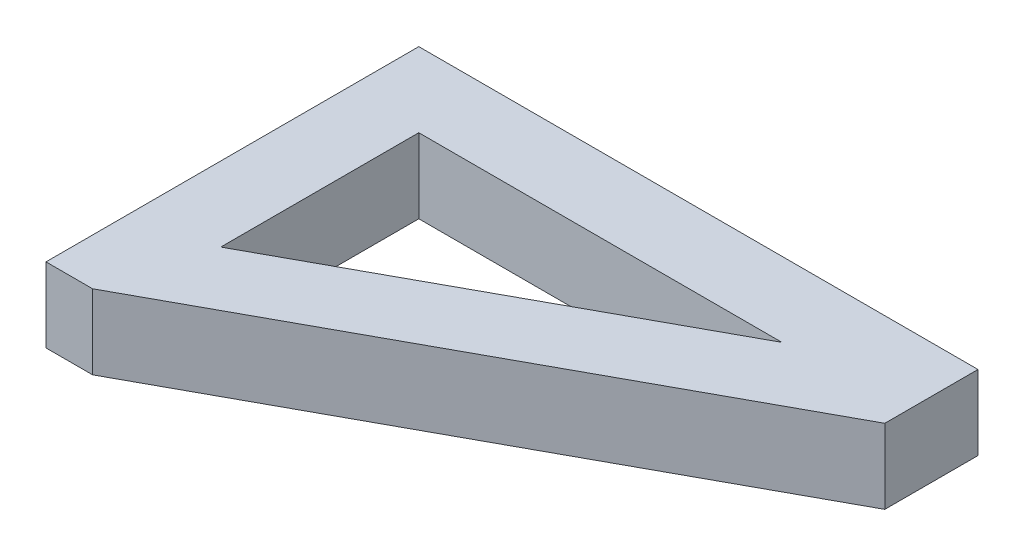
ISO-10303-21;
HEADER;
FILE_DESCRIPTION(('STEP AP214'),'2;1');
FILE_NAME('part.step','',(''),(''),'','','');
FILE_SCHEMA(('AUTOMOTIVE_DESIGN { 1 0 10303 214 1 1 1 1 }'));
ENDSEC;
DATA;
#1=APPLICATION_CONTEXT('core data for automotive mechanical design processes');
#2=APPLICATION_PROTOCOL_DEFINITION('international standard','automotive_design',2000,#1);
#3=PRODUCT_CONTEXT('',#1,'mechanical');
#4=PRODUCT('Part','Part','',(#3));
#5=PRODUCT_RELATED_PRODUCT_CATEGORY('part','',(#4));
#6=PRODUCT_DEFINITION_FORMATION('','',#4);
#7=PRODUCT_DEFINITION_CONTEXT('part definition',#1,'design');
#8=PRODUCT_DEFINITION('design','',#6,#7);
#9=PRODUCT_DEFINITION_SHAPE('','',#8);
#10=(LENGTH_UNIT() NAMED_UNIT(*) SI_UNIT(.MILLI.,.METRE.));
#11=(NAMED_UNIT(*) PLANE_ANGLE_UNIT() SI_UNIT($,.RADIAN.));
#12=(NAMED_UNIT(*) SI_UNIT($,.STERADIAN.) SOLID_ANGLE_UNIT());
#13=UNCERTAINTY_MEASURE_WITH_UNIT(LENGTH_MEASURE(1.E-05),#10,'distance_accuracy_value','');
#14=(GEOMETRIC_REPRESENTATION_CONTEXT(3) GLOBAL_UNCERTAINTY_ASSIGNED_CONTEXT((#13)) GLOBAL_UNIT_ASSIGNED_CONTEXT((#10,
#11,#12)) REPRESENTATION_CONTEXT('',''));
#15=CARTESIAN_POINT('',(0.,0.,0.));
#16=DIRECTION('',(0.,0.,1.));
#17=DIRECTION('',(1.,0.,0.));
#18=AXIS2_PLACEMENT_3D('',#15,#16,#17);
#19=CARTESIAN_POINT('',(0.,20.,0.));
#20=DIRECTION('',(0.,-1.,0.));
#21=DIRECTION('',(0.,0.,-1.));
#22=AXIS2_PLACEMENT_3D('',#19,#20,#21);
#23=PLANE('',#22);
#24=DIRECTION('',(1.,0.,0.));
#25=VECTOR('',#24,1.);
#26=CARTESIAN_POINT('',(12.5,20.,0.));
#27=LINE('',#26,#25);
#28=CARTESIAN_POINT('',(0.,20.,0.));
#29=VERTEX_POINT('',#28);
#30=CARTESIAN_POINT('',(12.5,20.,0.));
#31=VERTEX_POINT('',#30);
#32=EDGE_CURVE('E124',#29,#31,#27,.T.);
#33=ORIENTED_EDGE('',*,*,#32,.T.);
#34=DIRECTION('',(0.877895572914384,0.,-0.478852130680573));
#35=VECTOR('',#34,1.);
#36=CARTESIAN_POINT('',(150.,20.,-75.));
#37=LINE('',#36,#35);
#38=CARTESIAN_POINT('',(150.,20.,-75.));
#39=VERTEX_POINT('',#38);
#40=EDGE_CURVE('E127',#31,#39,#37,.T.);
#41=ORIENTED_EDGE('',*,*,#40,.T.);
#42=DIRECTION('',(0.,0.,-1.));
#43=VECTOR('',#42,1.);
#44=CARTESIAN_POINT('',(150.,20.,-100.));
#45=LINE('',#44,#43);
#46=CARTESIAN_POINT('',(150.,20.,-100.));
#47=VERTEX_POINT('',#46);
#48=EDGE_CURVE('E130',#39,#47,#45,.T.);
#49=ORIENTED_EDGE('',*,*,#48,.T.);
#50=DIRECTION('',(-1.,0.,0.));
#51=VECTOR('',#50,1.);
#52=CARTESIAN_POINT('',(0.,20.,-100.));
#53=LINE('',#52,#51);
#54=CARTESIAN_POINT('',(0.,20.,-100.));
#55=VERTEX_POINT('',#54);
#56=EDGE_CURVE('E132',#47,#55,#53,.T.);
#57=ORIENTED_EDGE('',*,*,#56,.T.);
#58=DIRECTION('',(0.,0.,1.));
#59=VECTOR('',#58,1.);
#60=CARTESIAN_POINT('',(0.,20.,0.));
#61=LINE('',#60,#59);
#62=EDGE_CURVE('E134',#55,#29,#61,.T.);
#63=ORIENTED_EDGE('',*,*,#62,.T.);
#64=EDGE_LOOP('',(#33,#41,#49,#57,#63));
#65=FACE_BOUND('',#64,.T.);
#66=DIRECTION('',(0.,0.,1.));
#67=VECTOR('',#66,1.);
#68=CARTESIAN_POINT('',(20.,20.,-26.872661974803));
#69=LINE('',#68,#67);
#70=CARTESIAN_POINT('',(20.,20.,-80.));
#71=VERTEX_POINT('',#70);
#72=CARTESIAN_POINT('',(20.,20.,-26.872661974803));
#73=VERTEX_POINT('',#72);
#74=EDGE_CURVE('E97',#71,#73,#69,.T.);
#75=ORIENTED_EDGE('',*,*,#74,.F.);
#76=DIRECTION('',(-1.,0.,0.));
#77=VECTOR('',#76,1.);
#78=CARTESIAN_POINT('',(20.,20.,-80.));
#79=LINE('',#78,#77);
#80=CARTESIAN_POINT('',(117.400119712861,20.,-80.));
#81=VERTEX_POINT('',#80);
#82=EDGE_CURVE('E114',#81,#71,#79,.T.);
#83=ORIENTED_EDGE('',*,*,#82,.F.);
#84=DIRECTION('',(0.877895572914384,0.,-0.478852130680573));
#85=VECTOR('',#84,1.);
#86=CARTESIAN_POINT('',(117.400119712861,20.,-80.));
#87=LINE('',#86,#85);
#88=EDGE_CURVE('E105',#73,#81,#87,.T.);
#89=ORIENTED_EDGE('',*,*,#88,.F.);
#90=EDGE_LOOP('',(#75,#83,#89));
#91=FACE_BOUND('',#90,.T.);
#92=ADVANCED_FACE('F32',(#65,#91),#23,.F.);
#93=CARTESIAN_POINT('',(0.,0.,0.));
#94=DIRECTION('',(0.,-1.,0.));
#95=DIRECTION('',(0.,0.,-1.));
#96=AXIS2_PLACEMENT_3D('',#93,#94,#95);
#97=PLANE('',#96);
#98=DIRECTION('',(1.,0.,0.));
#99=VECTOR('',#98,1.);
#100=CARTESIAN_POINT('',(12.5,0.,0.));
#101=LINE('',#100,#99);
#102=CARTESIAN_POINT('',(0.,0.,0.));
#103=VERTEX_POINT('',#102);
#104=CARTESIAN_POINT('',(12.5,0.,0.));
#105=VERTEX_POINT('',#104);
#106=EDGE_CURVE('E112',#103,#105,#101,.T.);
#107=ORIENTED_EDGE('',*,*,#106,.F.);
#108=DIRECTION('',(0.,0.,1.));
#109=VECTOR('',#108,1.);
#110=CARTESIAN_POINT('',(0.,0.,0.));
#111=LINE('',#110,#109);
#112=CARTESIAN_POINT('',(0.,0.,-100.));
#113=VERTEX_POINT('',#112);
#114=EDGE_CURVE('E128',#113,#103,#111,.T.);
#115=ORIENTED_EDGE('',*,*,#114,.F.);
#116=DIRECTION('',(-1.,0.,0.));
#117=VECTOR('',#116,1.);
#118=CARTESIAN_POINT('',(0.,0.,-100.));
#119=LINE('',#118,#117);
#120=CARTESIAN_POINT('',(150.,0.,-100.));
#121=VERTEX_POINT('',#120);
#122=EDGE_CURVE('E143',#121,#113,#119,.T.);
#123=ORIENTED_EDGE('',*,*,#122,.F.);
#124=DIRECTION('',(0.,0.,-1.));
#125=VECTOR('',#124,1.);
#126=CARTESIAN_POINT('',(150.,0.,-100.));
#127=LINE('',#126,#125);
#128=CARTESIAN_POINT('',(150.,0.,-75.));
#129=VERTEX_POINT('',#128);
#130=EDGE_CURVE('E141',#129,#121,#127,.T.);
#131=ORIENTED_EDGE('',*,*,#130,.F.);
#132=DIRECTION('',(0.877895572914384,0.,-0.478852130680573));
#133=VECTOR('',#132,1.);
#134=CARTESIAN_POINT('',(150.,0.,-75.));
#135=LINE('',#134,#133);
#136=EDGE_CURVE('E139',#105,#129,#135,.T.);
#137=ORIENTED_EDGE('',*,*,#136,.F.);
#138=EDGE_LOOP('',(#107,#115,#123,#131,#137));
#139=FACE_BOUND('',#138,.T.);
#140=DIRECTION('',(-1.,0.,0.));
#141=VECTOR('',#140,1.);
#142=CARTESIAN_POINT('',(20.,0.,-80.));
#143=LINE('',#142,#141);
#144=CARTESIAN_POINT('',(117.400119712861,0.,-80.));
#145=VERTEX_POINT('',#144);
#146=CARTESIAN_POINT('',(20.,0.,-80.));
#147=VERTEX_POINT('',#146);
#148=EDGE_CURVE('E106',#145,#147,#143,.T.);
#149=ORIENTED_EDGE('',*,*,#148,.T.);
#150=DIRECTION('',(0.,0.,1.));
#151=VECTOR('',#150,1.);
#152=CARTESIAN_POINT('',(20.,0.,-26.872661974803));
#153=LINE('',#152,#151);
#154=CARTESIAN_POINT('',(20.,0.,-26.872661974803));
#155=VERTEX_POINT('',#154);
#156=EDGE_CURVE('E55',#147,#155,#153,.T.);
#157=ORIENTED_EDGE('',*,*,#156,.T.);
#158=DIRECTION('',(0.877895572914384,0.,-0.478852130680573));
#159=VECTOR('',#158,1.);
#160=CARTESIAN_POINT('',(117.400119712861,0.,-80.));
#161=LINE('',#160,#159);
#162=EDGE_CURVE('E111',#155,#145,#161,.T.);
#163=ORIENTED_EDGE('',*,*,#162,.T.);
#164=EDGE_LOOP('',(#149,#157,#163));
#165=FACE_BOUND('',#164,.T.);
#166=ADVANCED_FACE('F164',(#139,#165),#97,.T.);
#167=CARTESIAN_POINT('',(12.5,20.,0.));
#168=DIRECTION('',(0.,0.,-1.));
#169=DIRECTION('',(-1.,0.,0.));
#170=AXIS2_PLACEMENT_3D('',#167,#168,#169);
#171=PLANE('',#170);
#172=ORIENTED_EDGE('',*,*,#106,.T.);
#173=DIRECTION('',(0.,-1.,0.));
#174=VECTOR('',#173,1.);
#175=CARTESIAN_POINT('',(12.5,20.,0.));
#176=LINE('',#175,#174);
#177=EDGE_CURVE('E11',#31,#105,#176,.T.);
#178=ORIENTED_EDGE('',*,*,#177,.F.);
#179=ORIENTED_EDGE('',*,*,#32,.F.);
#180=DIRECTION('',(0.,-1.,0.));
#181=VECTOR('',#180,1.);
#182=CARTESIAN_POINT('',(0.,20.,0.));
#183=LINE('',#182,#181);
#184=EDGE_CURVE('E136',#29,#103,#183,.T.);
#185=ORIENTED_EDGE('',*,*,#184,.T.);
#186=EDGE_LOOP('',(#172,#178,#179,#185));
#187=FACE_BOUND('',#186,.T.);
#188=ADVANCED_FACE('F34',(#187),#171,.F.);
#189=CARTESIAN_POINT('',(150.,20.,-75.));
#190=DIRECTION('',(-0.478852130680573,0.,-0.877895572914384));
#191=DIRECTION('',(-0.877895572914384,0.,0.478852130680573));
#192=AXIS2_PLACEMENT_3D('',#189,#190,#191);
#193=PLANE('',#192);
#194=ORIENTED_EDGE('',*,*,#136,.T.);
#195=DIRECTION('',(0.,-1.,0.));
#196=VECTOR('',#195,1.);
#197=CARTESIAN_POINT('',(150.,20.,-75.));
#198=LINE('',#197,#196);
#199=EDGE_CURVE('E40',#39,#129,#198,.T.);
#200=ORIENTED_EDGE('',*,*,#199,.F.);
#201=ORIENTED_EDGE('',*,*,#40,.F.);
#202=ORIENTED_EDGE('',*,*,#177,.T.);
#203=EDGE_LOOP('',(#194,#200,#201,#202));
#204=FACE_BOUND('',#203,.T.);
#205=ADVANCED_FACE('F178',(#204),#193,.F.);
#206=CARTESIAN_POINT('',(150.,20.,-100.));
#207=DIRECTION('',(-1.,0.,0.));
#208=DIRECTION('',(0.,0.,1.));
#209=AXIS2_PLACEMENT_3D('',#206,#207,#208);
#210=PLANE('',#209);
#211=ORIENTED_EDGE('',*,*,#130,.T.);
#212=DIRECTION('',(0.,-1.,0.));
#213=VECTOR('',#212,1.);
#214=CARTESIAN_POINT('',(150.,20.,-100.));
#215=LINE('',#214,#213);
#216=EDGE_CURVE('E151',#47,#121,#215,.T.);
#217=ORIENTED_EDGE('',*,*,#216,.F.);
#218=ORIENTED_EDGE('',*,*,#48,.F.);
#219=ORIENTED_EDGE('',*,*,#199,.T.);
#220=EDGE_LOOP('',(#211,#217,#218,#219));
#221=FACE_BOUND('',#220,.T.);
#222=ADVANCED_FACE('F158',(#221),#210,.F.);
#223=CARTESIAN_POINT('',(0.,20.,-100.));
#224=DIRECTION('',(0.,0.,1.));
#225=DIRECTION('',(1.,0.,0.));
#226=AXIS2_PLACEMENT_3D('',#223,#224,#225);
#227=PLANE('',#226);
#228=ORIENTED_EDGE('',*,*,#122,.T.);
#229=DIRECTION('',(0.,-1.,0.));
#230=VECTOR('',#229,1.);
#231=CARTESIAN_POINT('',(0.,20.,-100.));
#232=LINE('',#231,#230);
#233=EDGE_CURVE('E148',#55,#113,#232,.T.);
#234=ORIENTED_EDGE('',*,*,#233,.F.);
#235=ORIENTED_EDGE('',*,*,#56,.F.);
#236=ORIENTED_EDGE('',*,*,#216,.T.);
#237=EDGE_LOOP('',(#228,#234,#235,#236));
#238=FACE_BOUND('',#237,.T.);
#239=ADVANCED_FACE('F169',(#238),#227,.F.);
#240=CARTESIAN_POINT('',(0.,20.,0.));
#241=DIRECTION('',(1.,0.,0.));
#242=DIRECTION('',(0.,0.,-1.));
#243=AXIS2_PLACEMENT_3D('',#240,#241,#242);
#244=PLANE('',#243);
#245=ORIENTED_EDGE('',*,*,#114,.T.);
#246=ORIENTED_EDGE('',*,*,#184,.F.);
#247=ORIENTED_EDGE('',*,*,#62,.F.);
#248=ORIENTED_EDGE('',*,*,#233,.T.);
#249=EDGE_LOOP('',(#245,#246,#247,#248));
#250=FACE_BOUND('',#249,.T.);
#251=ADVANCED_FACE('F173',(#250),#244,.F.);
#252=CARTESIAN_POINT('',(20.,20.,-26.872661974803));
#253=DIRECTION('',(1.,0.,0.));
#254=DIRECTION('',(0.,0.,-1.));
#255=AXIS2_PLACEMENT_3D('',#252,#253,#254);
#256=PLANE('',#255);
#257=ORIENTED_EDGE('',*,*,#156,.F.);
#258=DIRECTION('',(0.,-1.,0.));
#259=VECTOR('',#258,1.);
#260=CARTESIAN_POINT('',(20.,20.,-80.));
#261=LINE('',#260,#259);
#262=EDGE_CURVE('E101',#71,#147,#261,.T.);
#263=ORIENTED_EDGE('',*,*,#262,.F.);
#264=ORIENTED_EDGE('',*,*,#74,.T.);
#265=DIRECTION('',(0.,-1.,0.));
#266=VECTOR('',#265,1.);
#267=CARTESIAN_POINT('',(20.,20.,-26.872661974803));
#268=LINE('',#267,#266);
#269=EDGE_CURVE('E100',#73,#155,#268,.T.);
#270=ORIENTED_EDGE('',*,*,#269,.T.);
#271=EDGE_LOOP('',(#257,#263,#264,#270));
#272=FACE_BOUND('',#271,.T.);
#273=ADVANCED_FACE('F99',(#272),#256,.T.);
#274=CARTESIAN_POINT('',(117.400119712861,20.,-80.));
#275=DIRECTION('',(-0.478852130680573,0.,-0.877895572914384));
#276=DIRECTION('',(-0.877895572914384,0.,0.478852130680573));
#277=AXIS2_PLACEMENT_3D('',#274,#275,#276);
#278=PLANE('',#277);
#279=ORIENTED_EDGE('',*,*,#162,.F.);
#280=ORIENTED_EDGE('',*,*,#269,.F.);
#281=ORIENTED_EDGE('',*,*,#88,.T.);
#282=DIRECTION('',(0.,-1.,0.));
#283=VECTOR('',#282,1.);
#284=CARTESIAN_POINT('',(117.400119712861,20.,-80.));
#285=LINE('',#284,#283);
#286=EDGE_CURVE('E47',#81,#145,#285,.T.);
#287=ORIENTED_EDGE('',*,*,#286,.T.);
#288=EDGE_LOOP('',(#279,#280,#281,#287));
#289=FACE_BOUND('',#288,.T.);
#290=ADVANCED_FACE('F109',(#289),#278,.T.);
#291=CARTESIAN_POINT('',(20.,20.,-80.));
#292=DIRECTION('',(0.,0.,1.));
#293=DIRECTION('',(1.,0.,0.));
#294=AXIS2_PLACEMENT_3D('',#291,#292,#293);
#295=PLANE('',#294);
#296=ORIENTED_EDGE('',*,*,#148,.F.);
#297=ORIENTED_EDGE('',*,*,#286,.F.);
#298=ORIENTED_EDGE('',*,*,#82,.T.);
#299=ORIENTED_EDGE('',*,*,#262,.T.);
#300=EDGE_LOOP('',(#296,#297,#298,#299));
#301=FACE_BOUND('',#300,.T.);
#302=ADVANCED_FACE('F221',(#301),#295,.T.);
#303=CLOSED_SHELL('',(#92,#166,#188,#205,#222,#239,#251,#273,#290,#302));
#304=MANIFOLD_SOLID_BREP('B2',#303);
#305=ADVANCED_BREP_SHAPE_REPRESENTATION('',(#18,#304),#14);
#306=SHAPE_DEFINITION_REPRESENTATION(#9,#305);
ENDSEC;
END-ISO-10303-21;
